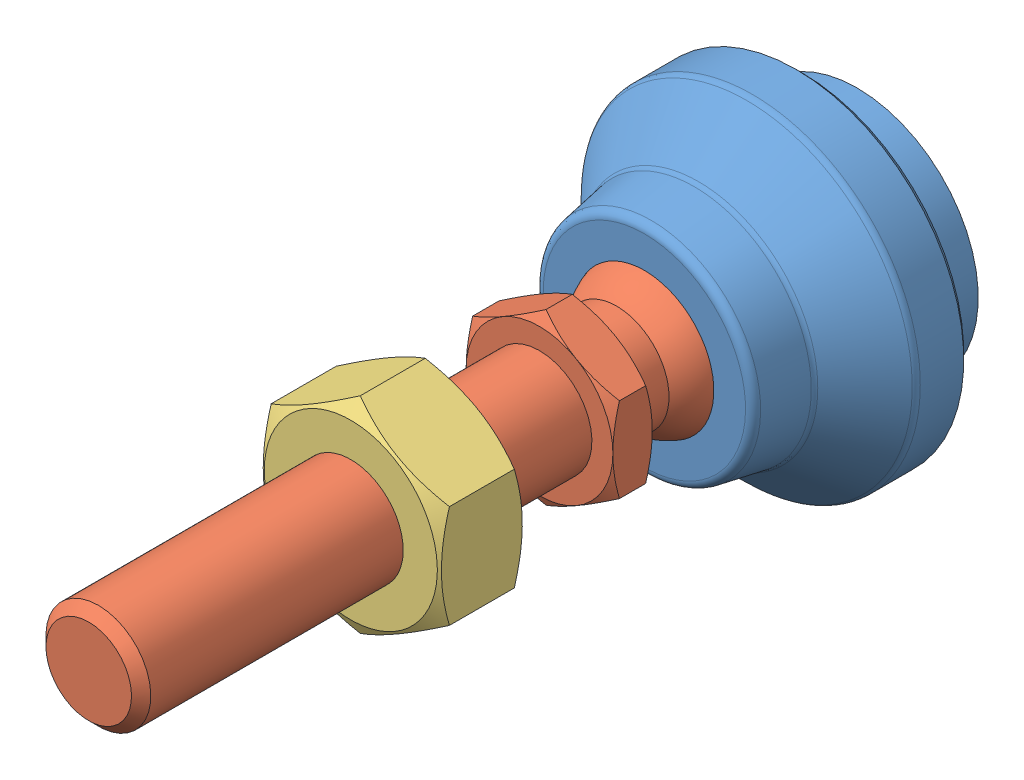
SolidWorks assembly LSVA32-M10X43-SUS.sldasm, configuration Default (file format 15000). Lengths in mm.
Overall size (32 32 73.3).
3 component instances, 3 part files, 0 mates.
Components (placement in the parent):
- LSVA32-M10X43-SUS_01-2: LSVA32-M10X43-SUS_01.sldprt [Default] at (0 0 5.3) x (1 0 0) z (0 -1 0) size (32 20.3 32)
- LSVA32-M10X43-SUS_02-1: LSVA32-M10X43-SUS_02.sldprt [Default] at (0 0 18.05) x (1 0 0) z (0 -1 0) size (14 62.25 16.17)
- LSVA32-M10X43-SUS_03-1: LSVA32-M10X43-SUS_03.sldprt [Default] at (0 0 40.3) size (17 19.63 8)
